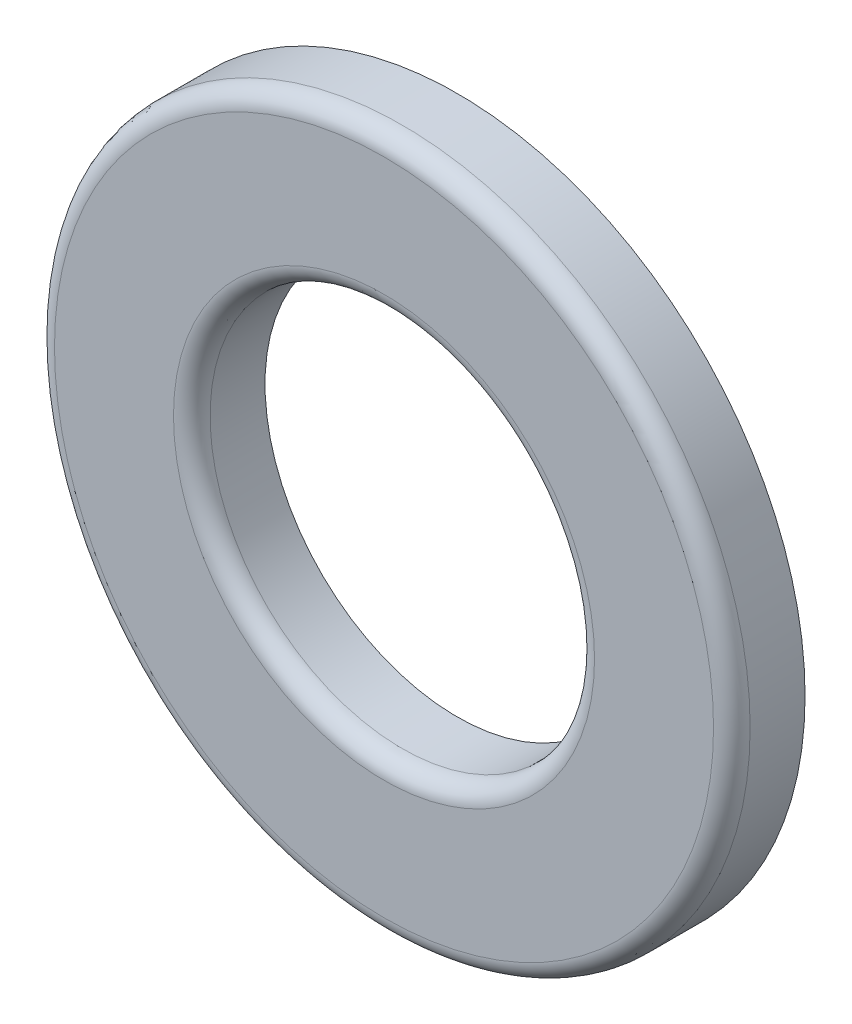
ISO-10303-21;
HEADER;
FILE_DESCRIPTION(('STEP AP214'),'2;1');
FILE_NAME('part.step','',(''),(''),'','','');
FILE_SCHEMA(('AUTOMOTIVE_DESIGN { 1 0 10303 214 1 1 1 1 }'));
ENDSEC;
DATA;
#1=APPLICATION_CONTEXT('core data for automotive mechanical design processes');
#2=APPLICATION_PROTOCOL_DEFINITION('international standard','automotive_design',2000,#1);
#3=PRODUCT_CONTEXT('',#1,'mechanical');
#4=PRODUCT('Part','Part','',(#3));
#5=PRODUCT_RELATED_PRODUCT_CATEGORY('part','',(#4));
#6=PRODUCT_DEFINITION_FORMATION('','',#4);
#7=PRODUCT_DEFINITION_CONTEXT('part definition',#1,'design');
#8=PRODUCT_DEFINITION('design','',#6,#7);
#9=PRODUCT_DEFINITION_SHAPE('','',#8);
#10=(LENGTH_UNIT() NAMED_UNIT(*) SI_UNIT(.MILLI.,.METRE.));
#11=(NAMED_UNIT(*) PLANE_ANGLE_UNIT() SI_UNIT($,.RADIAN.));
#12=(NAMED_UNIT(*) SI_UNIT($,.STERADIAN.) SOLID_ANGLE_UNIT());
#13=UNCERTAINTY_MEASURE_WITH_UNIT(LENGTH_MEASURE(1.E-05),#10,'distance_accuracy_value','');
#14=(GEOMETRIC_REPRESENTATION_CONTEXT(3) GLOBAL_UNCERTAINTY_ASSIGNED_CONTEXT((#13)) GLOBAL_UNIT_ASSIGNED_CONTEXT((#10,
#11,#12)) REPRESENTATION_CONTEXT('',''));
#15=CARTESIAN_POINT('',(0.,0.,0.));
#16=DIRECTION('',(0.,0.,1.));
#17=DIRECTION('',(1.,0.,0.));
#18=AXIS2_PLACEMENT_3D('',#15,#16,#17);
#19=CARTESIAN_POINT('',(2.33146835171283E-12,-1.38777878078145E-13,1.99999999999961));
#20=DIRECTION('',(0.,0.,1.));
#21=DIRECTION('',(1.,0.,0.));
#22=AXIS2_PLACEMENT_3D('',#19,#20,#21);
#23=PLANE('',#22);
#24=CARTESIAN_POINT('',(2.33146835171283E-12,-1.38777878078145E-13,1.99999999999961));
#25=DIRECTION('',(0.,0.,1.));
#26=DIRECTION('',(1.,0.,0.));
#27=AXIS2_PLACEMENT_3D('',#24,#25,#26);
#28=CIRCLE('',#27,9.);
#29=CARTESIAN_POINT('',(9.00000000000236,-1.41775480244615E-13,1.99999999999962));
#30=VERTEX_POINT('',#29);
#31=EDGE_CURVE('E37',#30,#30,#28,.T.);
#32=ORIENTED_EDGE('',*,*,#31,.T.);
#33=EDGE_LOOP('',(#32));
#34=FACE_BOUND('',#33,.T.);
#35=CARTESIAN_POINT('',(2.33146835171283E-12,-1.38777878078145E-13,1.99999999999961));
#36=DIRECTION('',(0.,0.,1.));
#37=DIRECTION('',(1.,0.,0.));
#38=AXIS2_PLACEMENT_3D('',#35,#36,#37);
#39=CIRCLE('',#38,5.75);
#40=CARTESIAN_POINT('',(5.75000000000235,-1.40693012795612E-13,1.99999999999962));
#41=VERTEX_POINT('',#40);
#42=EDGE_CURVE('E41',#41,#41,#39,.F.);
#43=ORIENTED_EDGE('',*,*,#42,.T.);
#44=EDGE_LOOP('',(#43));
#45=FACE_BOUND('',#44,.T.);
#46=ADVANCED_FACE('F26',(#34,#45),#23,.T.);
#47=CARTESIAN_POINT('',(1.33226762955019E-12,-6.66133814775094E-13,0.));
#48=DIRECTION('',(0.,0.,1.));
#49=DIRECTION('',(1.,0.,0.));
#50=AXIS2_PLACEMENT_3D('',#47,#48,#49);
#51=PLANE('',#50);
#52=CARTESIAN_POINT('',(1.33226762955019E-12,-6.66133814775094E-13,0.));
#53=DIRECTION('',(0.,0.,1.));
#54=DIRECTION('',(1.,0.,0.));
#55=AXIS2_PLACEMENT_3D('',#52,#53,#54);
#56=CIRCLE('',#55,9.5);
#57=CARTESIAN_POINT('',(9.50000000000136,-6.69297950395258E-13,0.));
#58=VERTEX_POINT('',#57);
#59=EDGE_CURVE('E46',#58,#58,#56,.T.);
#60=ORIENTED_EDGE('',*,*,#59,.F.);
#61=EDGE_LOOP('',(#60));
#62=FACE_BOUND('',#61,.T.);
#63=CARTESIAN_POINT('',(1.33226762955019E-12,-6.66133814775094E-13,0.));
#64=DIRECTION('',(0.,0.,1.));
#65=DIRECTION('',(1.,0.,0.));
#66=AXIS2_PLACEMENT_3D('',#63,#64,#65);
#67=CIRCLE('',#66,5.25);
#68=CARTESIAN_POINT('',(5.25000000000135,-6.67882416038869E-13,0.));
#69=VERTEX_POINT('',#68);
#70=EDGE_CURVE('E49',#69,#69,#67,.T.);
#71=ORIENTED_EDGE('',*,*,#70,.T.);
#72=EDGE_LOOP('',(#71));
#73=FACE_BOUND('',#72,.T.);
#74=ADVANCED_FACE('F53',(#62,#73),#51,.F.);
#75=CARTESIAN_POINT('',(2.33146835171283E-12,-1.38777878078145E-13,1.99999999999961));
#76=DIRECTION('',(0.,0.,-1.));
#77=DIRECTION('',(-1.,0.,0.));
#78=AXIS2_PLACEMENT_3D('',#75,#76,#77);
#79=CYLINDRICAL_SURFACE('',#78,9.5);
#80=CARTESIAN_POINT('',(9.99200722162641E-13,-4.9960036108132E-13,1.49999999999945));
#81=DIRECTION('',(0.,0.,1.));
#82=DIRECTION('',(1.,0.,0.));
#83=AXIS2_PLACEMENT_3D('',#80,#81,#82);
#84=CIRCLE('',#83,9.5);
#85=CARTESIAN_POINT('',(9.50000000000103,-5.02764496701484E-13,1.49999999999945));
#86=VERTEX_POINT('',#85);
#87=EDGE_CURVE('E33',#86,#86,#84,.F.);
#88=ORIENTED_EDGE('',*,*,#87,.T.);
#89=EDGE_LOOP('',(#88));
#90=FACE_BOUND('',#89,.T.);
#91=ORIENTED_EDGE('',*,*,#59,.T.);
#92=EDGE_LOOP('',(#91));
#93=FACE_BOUND('',#92,.T.);
#94=ADVANCED_FACE('F28',(#90,#93),#79,.T.);
#95=CARTESIAN_POINT('',(2.33146835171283E-12,-1.38777878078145E-13,1.99999999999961));
#96=DIRECTION('',(0.,0.,-1.));
#97=DIRECTION('',(-1.,0.,0.));
#98=AXIS2_PLACEMENT_3D('',#95,#96,#97);
#99=CYLINDRICAL_SURFACE('',#98,5.25);
#100=CARTESIAN_POINT('',(9.99200722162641E-13,-4.9960036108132E-13,1.49999999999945));
#101=DIRECTION('',(0.,0.,1.));
#102=DIRECTION('',(1.,0.,0.));
#103=AXIS2_PLACEMENT_3D('',#100,#101,#102);
#104=CIRCLE('',#103,5.25);
#105=CARTESIAN_POINT('',(5.25000000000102,-5.01348962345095E-13,1.49999999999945));
#106=VERTEX_POINT('',#105);
#107=EDGE_CURVE('E10',#106,#106,#104,.T.);
#108=ORIENTED_EDGE('',*,*,#107,.T.);
#109=EDGE_LOOP('',(#108));
#110=FACE_BOUND('',#109,.T.);
#111=ORIENTED_EDGE('',*,*,#70,.F.);
#112=EDGE_LOOP('',(#111));
#113=FACE_BOUND('',#112,.T.);
#114=ADVANCED_FACE('F55',(#110,#113),#99,.F.);
#115=CARTESIAN_POINT('',(9.99200722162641E-13,-4.9960036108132E-13,1.49999999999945));
#116=DIRECTION('',(0.,0.,1.));
#117=DIRECTION('',(1.,0.,0.));
#118=AXIS2_PLACEMENT_3D('',#115,#116,#117);
#119=TOROIDAL_SURFACE('',#118,9.,0.5);
#120=ORIENTED_EDGE('',*,*,#87,.F.);
#121=EDGE_LOOP('',(#120));
#122=FACE_BOUND('',#121,.T.);
#123=ORIENTED_EDGE('',*,*,#31,.F.);
#124=EDGE_LOOP('',(#123));
#125=FACE_BOUND('',#124,.T.);
#126=ADVANCED_FACE('F57',(#122,#125),#119,.T.);
#127=CARTESIAN_POINT('',(9.99200722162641E-13,-4.9960036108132E-13,1.49999999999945));
#128=DIRECTION('',(0.,0.,1.));
#129=DIRECTION('',(1.,0.,0.));
#130=AXIS2_PLACEMENT_3D('',#127,#128,#129);
#131=TOROIDAL_SURFACE('',#130,5.75,0.5);
#132=ORIENTED_EDGE('',*,*,#42,.F.);
#133=EDGE_LOOP('',(#132));
#134=FACE_BOUND('',#133,.T.);
#135=ORIENTED_EDGE('',*,*,#107,.F.);
#136=EDGE_LOOP('',(#135));
#137=FACE_BOUND('',#136,.T.);
#138=ADVANCED_FACE('F63',(#134,#137),#131,.T.);
#139=CLOSED_SHELL('',(#46,#74,#94,#114,#126,#138));
#140=MANIFOLD_SOLID_BREP('B2',#139);
#141=ADVANCED_BREP_SHAPE_REPRESENTATION('',(#18,#140),#14);
#142=SHAPE_DEFINITION_REPRESENTATION(#9,#141);
ENDSEC;
END-ISO-10303-21;
